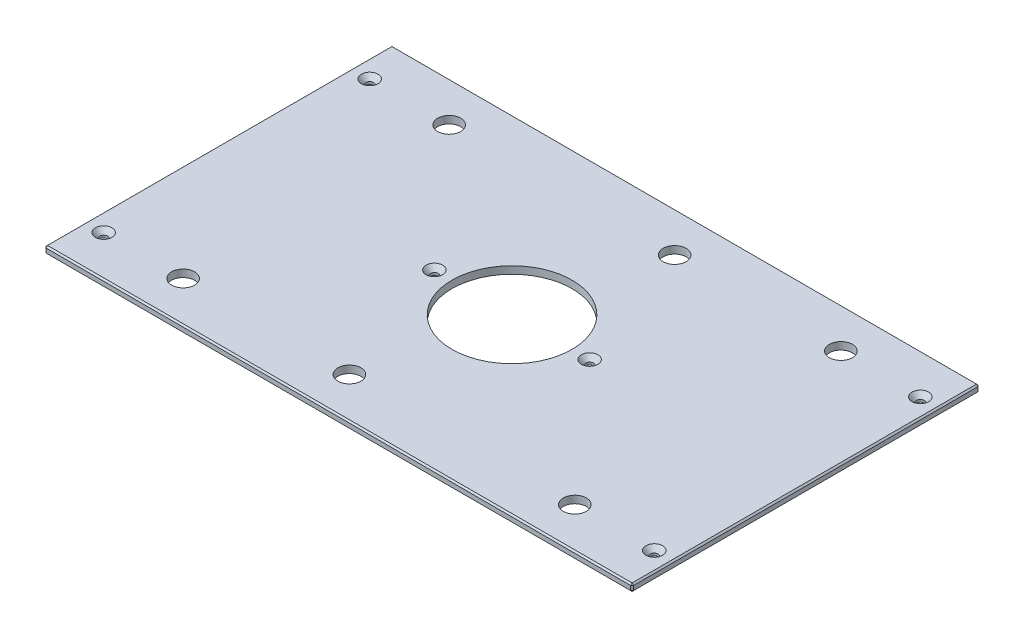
from build123d import *

# Parameters (mm, degrees)
SKETCH1_W                                     = 504.825
SKETCH1_H                                     = 298.45
BOSS_EXTRUDE1_DEPTH                           = 6.35
SKETCH13_R                                    = 51.562
CUT_EXTRUDE6_DEPTH                            = 294.292504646
F_25_32_0_78125_DIAMETER_HOLE1_D              = 19.84375
CHAMFER2_SIZE                                 = 1.27
CSK_FOR_1_4_FLAT_HEAD_MACHINE_SCREW1_AT_COUNT = 2
CSK_FOR_1_4_FLAT_HEAD_MACHINE_SCREW1_AT_PITCH = 228.6
CSK_FOR_1_4_FLAT_HEAD_MACHINE_SCREW1_2_COUNT  = 2
CSK_FOR_1_4_FLAT_HEAD_MACHINE_SCREW1_2_PITCH  = 525.412138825
CSK_FOR_1_4_FLAT_HEAD_MACHINE_SCREW1_3_COUNT  = 2
CSK_FOR_1_4_FLAT_HEAD_MACHINE_SCREW1_3_PITCH  = 324.040599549
CSK_FOR_1_4_FLAT_HEAD_MACHINE_SCREW1_4_COUNT  = 2
CSK_FOR_1_4_FLAT_HEAD_MACHINE_SCREW1_4_PITCH  = 204.738269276
CSK_FOR_1_4_FLAT_HEAD_MACHINE_SCREW1_5_COUNT  = 2
CSK_FOR_1_4_FLAT_HEAD_MACHINE_SCREW1_5_PITCH  = 473.075
CSK_FOR_1_4_FLAT_HEAD_MACHINE_SCREW1_6_COUNT  = 2
CSK_FOR_1_4_FLAT_HEAD_MACHINE_SCREW1_6_PITCH  = 404.8125
CSK_FOR_1_4_FLAT_HEAD_MACHINE_SCREW1_7_COUNT  = 2
CSK_FOR_1_4_FLAT_HEAD_MACHINE_SCREW1_7_PITCH  = 464.899042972


with BuildPart() as part:
    # Sketch1 → Boss-Extrude1 (new body)
    with BuildSketch(Plane(origin=(0, 0, 0), x_dir=(1, 0, 0), z_dir=(0, 1, 0))):
        Rectangle(SKETCH1_W, SKETCH1_H)
    extrude(amount=BOSS_EXTRUDE1_DEPTH)

    # Sketch13 → Cut-Extrude6 (cut, through all)
    with BuildSketch(Plane(origin=(0, 6.35, 0), x_dir=(1, 0, 0), z_dir=(0, 1, 0))):
        with Locations(Location((0, 0, 0), (0, 0, 270))):
            Circle(SKETCH13_R)
    extrude(amount=-CUT_EXTRUDE6_DEPTH, mode=Mode.SUBTRACT)

    # 25_32 _0.78125_ Diameter Hole1 (through all)
    with Locations(Plane(origin=(0, 6.35, 0), x_dir=(1, 0, 0), z_dir=(0, 1, 0))):
        with Locations((168.275, 114.3), (-168.275, 114.3), (168.275, -114.3), (-168.275, -114.3), (25.4, 114.3), (-25.4, -114.3)):
            Hole(F_25_32_0_78125_DIAMETER_HOLE1_D / 2)

    # Chamfer2
    chamfer2_edges = [part.edges().sort_by_distance(p)[0] for p in [
        (252.4125, 6.35, 0),
        (0, 6.35, -149.225),
        (-252.4125, 6.35, 0),
        (0, 0, -149.225),
        (252.4125, 0, 0),
        (0, 0, 149.225),
        (-252.4125, 0, 0),
        (0, 6.35, 149.225),
        (-252.4125, 3.175, -149.225),
        (252.4125, 3.175, -149.225),
        (252.4125, 3.175, 149.225),
        (-252.4125, 3.175, 149.225),
    ]]
    chamfer(chamfer2_edges, length=CHAMFER2_SIZE)

    # Sketch24 → CSK for 1_4 Flat Head Machine Screw1 (revolve, cut)
    with BuildSketch(Plane(origin=(236.5375, 6.35, -114.3), x_dir=(0, 0, 1), z_dir=(1, 0, 0))):
        Polygon((0, 0), (0, 6.35), (3.3782, 6.35), (3.3782, 4.324464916), (7.1374, 0), align=None)
    csk_for_1_4_flat_head_machine_screw1 = revolve(axis=Axis((236.5375, 12.7, -114.3), (0, -1, 0)), mode=Mode.SUBTRACT)

    # CSK for 1_4 Flat Head Machine Screw1 at: CSK for 1_4 Flat Head Machine Screw1 ×2
    with Locations(*[(0, 0, i * CSK_FOR_1_4_FLAT_HEAD_MACHINE_SCREW1_AT_PITCH) for i in range(1, CSK_FOR_1_4_FLAT_HEAD_MACHINE_SCREW1_AT_COUNT)]):
        add(csk_for_1_4_flat_head_machine_screw1, mode=Mode.SUBTRACT)

    # CSK for 1_4 Flat Head Machine Screw1 2: CSK for 1_4 Flat Head Machine Screw1 ×2
    with Locations(*[Vector(-0.9003884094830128, 0, 0.43508701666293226) * (i * CSK_FOR_1_4_FLAT_HEAD_MACHINE_SCREW1_2_PITCH) for i in range(1, CSK_FOR_1_4_FLAT_HEAD_MACHINE_SCREW1_2_COUNT)]):
        add(csk_for_1_4_flat_head_machine_screw1, mode=Mode.SUBTRACT)

    # CSK for 1_4 Flat Head Machine Screw1 3: CSK for 1_4 Flat Head Machine Screw1 ×2
    with Locations(*[Vector(-0.9357237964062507, 0, 0.3527335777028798) * (i * CSK_FOR_1_4_FLAT_HEAD_MACHINE_SCREW1_3_PITCH) for i in range(1, CSK_FOR_1_4_FLAT_HEAD_MACHINE_SCREW1_3_COUNT)]):
        add(csk_for_1_4_flat_head_machine_screw1, mode=Mode.SUBTRACT)

    # CSK for 1_4 Flat Head Machine Screw1 4: CSK for 1_4 Flat Head Machine Screw1 ×2
    with Locations(*[Vector(-0.829656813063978, 0, 0.5582737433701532) * (i * CSK_FOR_1_4_FLAT_HEAD_MACHINE_SCREW1_4_PITCH) for i in range(1, CSK_FOR_1_4_FLAT_HEAD_MACHINE_SCREW1_4_COUNT)]):
        add(csk_for_1_4_flat_head_machine_screw1, mode=Mode.SUBTRACT)

    # CSK for 1_4 Flat Head Machine Screw1 5: CSK for 1_4 Flat Head Machine Screw1 ×2
    with Locations(*[(-i * CSK_FOR_1_4_FLAT_HEAD_MACHINE_SCREW1_5_PITCH, 0, 0) for i in range(1, CSK_FOR_1_4_FLAT_HEAD_MACHINE_SCREW1_5_COUNT)]):
        add(csk_for_1_4_flat_head_machine_screw1, mode=Mode.SUBTRACT)

    # CSK for 1_4 Flat Head Machine Screw1 6: CSK for 1_4 Flat Head Machine Screw1 ×2
    with Locations(*[(-i * CSK_FOR_1_4_FLAT_HEAD_MACHINE_SCREW1_6_PITCH, 0, 0) for i in range(1, CSK_FOR_1_4_FLAT_HEAD_MACHINE_SCREW1_6_COUNT)]):
        add(csk_for_1_4_flat_head_machine_screw1, mode=Mode.SUBTRACT)

    # CSK for 1_4 Flat Head Machine Screw1 7: CSK for 1_4 Flat Head Machine Screw1 ×2
    with Locations(*[Vector(-0.870753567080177, 0, 0.49171966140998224) * (i * CSK_FOR_1_4_FLAT_HEAD_MACHINE_SCREW1_7_PITCH) for i in range(1, CSK_FOR_1_4_FLAT_HEAD_MACHINE_SCREW1_7_COUNT)]):
        add(csk_for_1_4_flat_head_machine_screw1, mode=Mode.SUBTRACT)


solid = part.part
